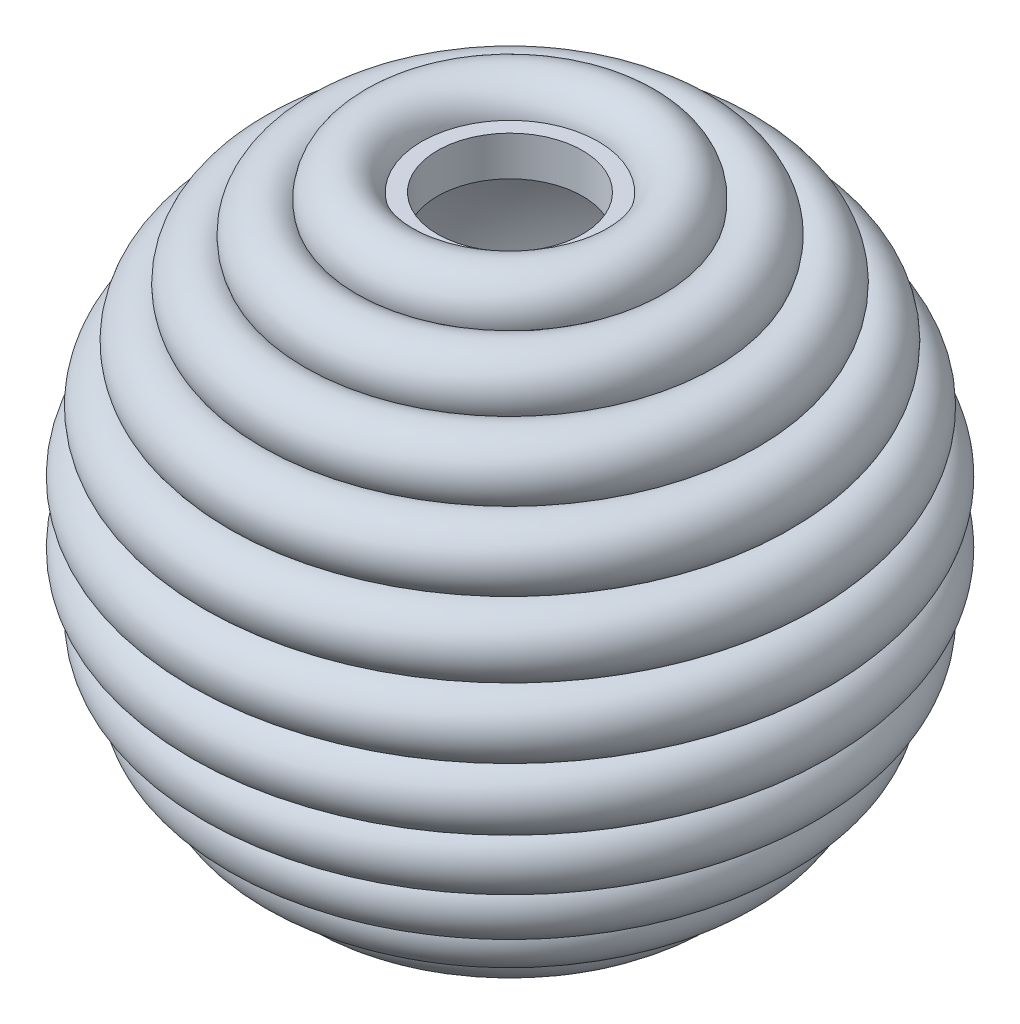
from build123d import *

# Parameters (mm, degrees)
SALIENTE_EXTRUIR1_DEPTH      = 1
SALIENTE_EXTRUIR1_DEPTH_BACK = 5
CROQUIS2_R                   = 15
CROQUIS3_R                   = 11
CORTAR_EXTRUIR1_DEPTH        = 10


with BuildPart() as part:
    # Croquis1 → Revoluci_n1 (revolve)
    with BuildSketch(Plane.XY, mode=Mode.PRIVATE) as revoluci_n1_sk:
        with BuildLine():
            Line((0, -44), (0, -50))
            ThreePointArc((0, -50), (-3.084456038, -48.935242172), (-4.855232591, -46.19445238))
            ThreePointArc((-4.855232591, -46.19445238), (-10.395584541, -48.907380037), (-14.353500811, -44.175533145))
            ThreePointArc((-14.353500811, -44.175533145), (-20.336832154, -45.677272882), (-23.224452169, -40.225931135))
            ThreePointArc((-23.224452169, -40.225931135), (-29.389262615, -40.450849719), (-31.080383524, -34.518262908))
            ThreePointArc((-31.080383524, -34.518262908), (-37.157241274, -33.456530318), (-37.57795298, -27.301980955))
            ThreePointArc((-37.57795298, -27.301980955), (-43.301270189, -25), (-42.43318557, -18.892471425))
            ThreePointArc((-42.43318557, -18.892471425), (-47.552825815, -15.450849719), (-45.433884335, -9.657270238))
            ThreePointArc((-45.433884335, -9.657270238), (-49.726094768, -5.226423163), (-46.448904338, 0))
            ThreePointArc((-46.448904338, 0), (-49.726094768, 5.226423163), (-45.433884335, 9.657270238))
            ThreePointArc((-45.433884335, 9.657270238), (-47.552825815, 15.450849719), (-42.43318557, 18.892471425))
            ThreePointArc((-42.43318557, 18.892471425), (-43.301270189, 25), (-37.57795298, 27.301980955))
            ThreePointArc((-37.57795298, 27.301980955), (-37.157241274, 33.456530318), (-31.080383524, 34.518262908))
            ThreePointArc((-31.080383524, 34.518262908), (-29.389262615, 40.450849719), (-23.224452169, 40.225931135))
            ThreePointArc((-23.224452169, 40.225931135), (-18.746704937, 46.089832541), (-13.303148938, 41.109545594))
            Line((-13.303148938, 41.109545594), (-15.684554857, 41.109545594))
            ThreePointArc((-15.684554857, 41.109545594), (-43.271353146, -7.974333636), (0, -44))
        make_face()
    revolve(revoluci_n1_sk.sketch.rotate(Axis((0, 43.869443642, 0), (0, -1, 0)), 270), axis=Axis((0, 43.869443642, 0), (0, -1, 0)))

    # Croquis2 → Saliente-Extruir1 (add, two sides: drawn at the far end of the back side and taken through both)
    with BuildSketch(Plane(origin=(0, 41, 0), x_dir=(1, 0, 0), z_dir=(0, 1, 0)).offset(-SALIENTE_EXTRUIR1_DEPTH_BACK)):
        with Locations(Location((0, 0, 0), (0, 0, 270))):
            Circle(CROQUIS2_R)
    extrude(amount=SALIENTE_EXTRUIR1_DEPTH + SALIENTE_EXTRUIR1_DEPTH_BACK)

    # Croquis3 → Cortar-Extruir1 (cut)
    with BuildSketch(Plane(origin=(0, 42, 0), x_dir=(1, 0, 0), z_dir=(0, 1, 0))):
        with Locations(Location((0, 0, 0), (0, 0, 270))):
            Circle(CROQUIS3_R)
    extrude(amount=-CORTAR_EXTRUIR1_DEPTH, mode=Mode.SUBTRACT)


solid = part.part
